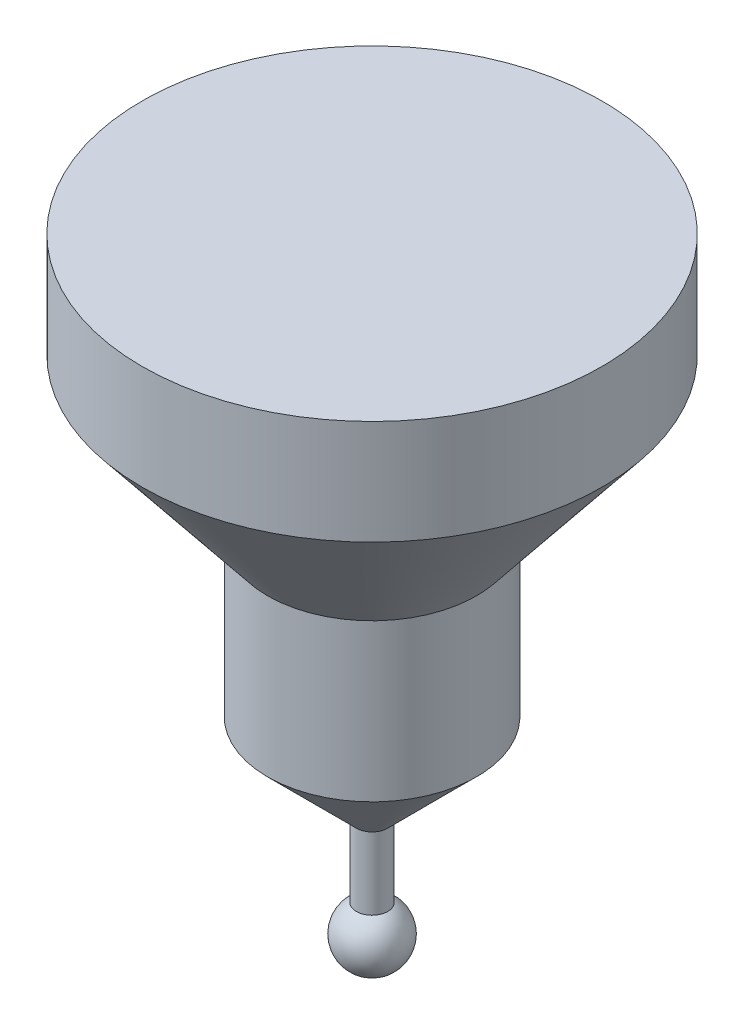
ISO-10303-21;
HEADER;
FILE_DESCRIPTION(('STEP AP214'),'2;1');
FILE_NAME('part.step','',(''),(''),'','','');
FILE_SCHEMA(('AUTOMOTIVE_DESIGN { 1 0 10303 214 1 1 1 1 }'));
ENDSEC;
DATA;
#1=APPLICATION_CONTEXT('core data for automotive mechanical design processes');
#2=APPLICATION_PROTOCOL_DEFINITION('international standard','automotive_design',2000,#1);
#3=PRODUCT_CONTEXT('',#1,'mechanical');
#4=PRODUCT('Part','Part','',(#3));
#5=PRODUCT_RELATED_PRODUCT_CATEGORY('part','',(#4));
#6=PRODUCT_DEFINITION_FORMATION('','',#4);
#7=PRODUCT_DEFINITION_CONTEXT('part definition',#1,'design');
#8=PRODUCT_DEFINITION('design','',#6,#7);
#9=PRODUCT_DEFINITION_SHAPE('','',#8);
#10=(LENGTH_UNIT() NAMED_UNIT(*) SI_UNIT(.MILLI.,.METRE.));
#11=(NAMED_UNIT(*) PLANE_ANGLE_UNIT() SI_UNIT($,.RADIAN.));
#12=(NAMED_UNIT(*) SI_UNIT($,.STERADIAN.) SOLID_ANGLE_UNIT());
#13=UNCERTAINTY_MEASURE_WITH_UNIT(LENGTH_MEASURE(1.E-05),#10,'distance_accuracy_value','');
#14=(GEOMETRIC_REPRESENTATION_CONTEXT(3) GLOBAL_UNCERTAINTY_ASSIGNED_CONTEXT((#13)) GLOBAL_UNIT_ASSIGNED_CONTEXT((#10,
#11,#12)) REPRESENTATION_CONTEXT('',''));
#15=CARTESIAN_POINT('',(0.,0.,0.));
#16=DIRECTION('',(0.,0.,1.));
#17=DIRECTION('',(1.,0.,0.));
#18=AXIS2_PLACEMENT_3D('',#15,#16,#17);
#19=CARTESIAN_POINT('',(0.,0.,0.));
#20=DIRECTION('',(0.,1.,0.));
#21=DIRECTION('',(-1.,0.,0.));
#22=AXIS2_PLACEMENT_3D('',#19,#20,#21);
#23=SPHERICAL_SURFACE('',#22,3.);
#24=CARTESIAN_POINT('',(0.,2.59807621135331,0.));
#25=DIRECTION('',(0.,1.,0.));
#26=DIRECTION('',(0.,0.,1.));
#27=AXIS2_PLACEMENT_3D('',#24,#25,#26);
#28=CIRCLE('',#27,1.50000000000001);
#29=CARTESIAN_POINT('',(0.,2.59807621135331,1.50000000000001));
#30=VERTEX_POINT('',#29);
#31=EDGE_CURVE('E10',#30,#30,#28,.T.);
#32=ORIENTED_EDGE('',*,*,#31,.F.);
#33=EDGE_LOOP('',(#32));
#34=FACE_BOUND('',#33,.T.);
#35=ADVANCED_FACE('F30',(#34),#23,.T.);
#36=CARTESIAN_POINT('',(0.,67.2438317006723,0.));
#37=DIRECTION('',(0.,1.,0.));
#38=DIRECTION('',(0.,0.,1.));
#39=AXIS2_PLACEMENT_3D('',#36,#37,#38);
#40=CYLINDRICAL_SURFACE('',#39,1.50000000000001);
#41=CARTESIAN_POINT('',(0.,9.4999999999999,0.));
#42=DIRECTION('',(0.,1.,0.));
#43=DIRECTION('',(0.,0.,1.));
#44=AXIS2_PLACEMENT_3D('',#41,#42,#43);
#45=CIRCLE('',#44,1.50000000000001);
#46=CARTESIAN_POINT('',(0.,9.4999999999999,1.50000000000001));
#47=VERTEX_POINT('',#46);
#48=EDGE_CURVE('E36',#47,#47,#45,.T.);
#49=ORIENTED_EDGE('',*,*,#48,.F.);
#50=EDGE_LOOP('',(#49));
#51=FACE_BOUND('',#50,.T.);
#52=ORIENTED_EDGE('',*,*,#31,.T.);
#53=EDGE_LOOP('',(#52));
#54=FACE_BOUND('',#53,.T.);
#55=ADVANCED_FACE('F78',(#51,#54),#40,.T.);
#56=CARTESIAN_POINT('',(0.,9.4999999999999,0.));
#57=DIRECTION('',(0.,1.,0.));
#58=DIRECTION('',(0.,0.,1.));
#59=AXIS2_PLACEMENT_3D('',#56,#57,#58);
#60=CONICAL_SURFACE('',#59,1.50000000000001,0.785398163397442);
#61=CARTESIAN_POINT('',(0.,18.,0.));
#62=DIRECTION('',(0.,1.,0.));
#63=DIRECTION('',(0.,0.,1.));
#64=AXIS2_PLACEMENT_3D('',#61,#62,#63);
#65=CIRCLE('',#64,10.);
#66=CARTESIAN_POINT('',(0.,18.,10.));
#67=VERTEX_POINT('',#66);
#68=EDGE_CURVE('E40',#67,#67,#65,.T.);
#69=CARTESIAN_POINT('',(0.,18.,10.));
#70=CARTESIAN_POINT('',(0.,17.9114583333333,9.91145833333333));
#71=CARTESIAN_POINT('',(0.,17.8229166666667,9.82291666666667));
#72=CARTESIAN_POINT('',(0.,17.6458333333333,9.64583333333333));
#73=CARTESIAN_POINT('',(0.,17.5572916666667,9.55729166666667));
#74=CARTESIAN_POINT('',(0.,17.3802083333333,9.38020833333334));
#75=CARTESIAN_POINT('',(0.,17.2916666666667,9.29166666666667));
#76=CARTESIAN_POINT('',(0.,17.1145833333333,9.11458333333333));
#77=CARTESIAN_POINT('',(0.,17.0260416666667,9.02604166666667));
#78=CARTESIAN_POINT('',(0.,16.8489583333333,8.84895833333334));
#79=CARTESIAN_POINT('',(0.,16.7604166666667,8.76041666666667));
#80=CARTESIAN_POINT('',(0.,16.5833333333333,8.58333333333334));
#81=CARTESIAN_POINT('',(0.,16.4947916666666,8.49479166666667));
#82=CARTESIAN_POINT('',(0.,16.3177083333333,8.31770833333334));
#83=CARTESIAN_POINT('',(0.,16.2291666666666,8.22916666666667));
#84=CARTESIAN_POINT('',(0.,16.0520833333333,8.05208333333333));
#85=CARTESIAN_POINT('',(0.,15.9635416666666,7.96354166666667));
#86=CARTESIAN_POINT('',(0.,15.7864583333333,7.78645833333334));
#87=CARTESIAN_POINT('',(0.,15.6979166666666,7.69791666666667));
#88=CARTESIAN_POINT('',(0.,15.5208333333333,7.52083333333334));
#89=CARTESIAN_POINT('',(0.,15.4322916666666,7.43229166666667));
#90=CARTESIAN_POINT('',(0.,15.2552083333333,7.25520833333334));
#91=CARTESIAN_POINT('',(0.,15.1666666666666,7.16666666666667));
#92=CARTESIAN_POINT('',(0.,14.9895833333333,6.98958333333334));
#93=CARTESIAN_POINT('',(0.,14.9010416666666,6.90104166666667));
#94=CARTESIAN_POINT('',(0.,14.7239583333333,6.72395833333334));
#95=CARTESIAN_POINT('',(0.,14.6354166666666,6.63541666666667));
#96=CARTESIAN_POINT('',(0.,14.4583333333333,6.45833333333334));
#97=CARTESIAN_POINT('',(0.,14.3697916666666,6.36979166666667));
#98=CARTESIAN_POINT('',(0.,14.1927083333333,6.19270833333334));
#99=CARTESIAN_POINT('',(0.,14.1041666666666,6.10416666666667));
#100=CARTESIAN_POINT('',(0.,13.9270833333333,5.92708333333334));
#101=CARTESIAN_POINT('',(0.,13.8385416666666,5.83854166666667));
#102=CARTESIAN_POINT('',(0.,13.6614583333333,5.66145833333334));
#103=CARTESIAN_POINT('',(0.,13.5729166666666,5.57291666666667));
#104=CARTESIAN_POINT('',(0.,13.3958333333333,5.39583333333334));
#105=CARTESIAN_POINT('',(0.,13.3072916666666,5.30729166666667));
#106=CARTESIAN_POINT('',(0.,13.1302083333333,5.13020833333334));
#107=CARTESIAN_POINT('',(0.,13.0416666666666,5.04166666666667));
#108=CARTESIAN_POINT('',(0.,12.8645833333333,4.86458333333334));
#109=CARTESIAN_POINT('',(0.,12.7760416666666,4.77604166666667));
#110=CARTESIAN_POINT('',(0.,12.5989583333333,4.59895833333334));
#111=CARTESIAN_POINT('',(0.,12.5104166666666,4.51041666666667));
#112=CARTESIAN_POINT('',(0.,12.3333333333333,4.33333333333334));
#113=CARTESIAN_POINT('',(0.,12.2447916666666,4.24479166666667));
#114=CARTESIAN_POINT('',(0.,12.0677083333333,4.06770833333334));
#115=CARTESIAN_POINT('',(0.,11.9791666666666,3.97916666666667));
#116=CARTESIAN_POINT('',(0.,11.8020833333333,3.80208333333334));
#117=CARTESIAN_POINT('',(0.,11.7135416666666,3.71354166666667));
#118=CARTESIAN_POINT('',(0.,11.5364583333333,3.53645833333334));
#119=CARTESIAN_POINT('',(0.,11.4479166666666,3.44791666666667));
#120=CARTESIAN_POINT('',(0.,11.2708333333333,3.27083333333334));
#121=CARTESIAN_POINT('',(0.,11.1822916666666,3.18229166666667));
#122=CARTESIAN_POINT('',(0.,11.0052083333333,3.00520833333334));
#123=CARTESIAN_POINT('',(0.,10.9166666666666,2.91666666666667));
#124=CARTESIAN_POINT('',(0.,10.7395833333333,2.73958333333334));
#125=CARTESIAN_POINT('',(0.,10.6510416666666,2.65104166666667));
#126=CARTESIAN_POINT('',(0.,10.4739583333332,2.47395833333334));
#127=CARTESIAN_POINT('',(0.,10.3854166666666,2.38541666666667));
#128=CARTESIAN_POINT('',(0.,10.2083333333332,2.20833333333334));
#129=CARTESIAN_POINT('',(0.,10.1197916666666,2.11979166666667));
#130=CARTESIAN_POINT('',(0.,9.94270833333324,1.94270833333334));
#131=CARTESIAN_POINT('',(0.,9.85416666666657,1.85416666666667));
#132=CARTESIAN_POINT('',(0.,9.67708333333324,1.67708333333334));
#133=CARTESIAN_POINT('',(0.,9.58854166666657,1.58854166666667));
#134=CARTESIAN_POINT('',(0.,9.4999999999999,1.50000000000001));
#135=B_SPLINE_CURVE_WITH_KNOTS('',3,(#69,#70,#71,#72,#73,#74,#75,#76,#77,#78,#79,#80,#81,#82,
#83,#84,#85,#86,#87,#88,#89,#90,#91,#92,#93,#94,#95,#96,#97,#98,#99,#100,#101,#102,#103,#104,
#105,#106,#107,#108,#109,#110,#111,#112,#113,#114,#115,#116,#117,#118,#119,#120,#121,#122,#123,
#124,#125,#126,#127,#128,#129,#130,#131,#132,#133,#134),.UNSPECIFIED.,.F.,.F.,(4,2,2,2,2,2,2,2,
2,2,2,2,2,2,2,2,2,2,2,2,2,2,2,2,2,2,2,2,2,2,2,2,4),(0.,0.375650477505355,0.751300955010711,
1.12695143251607,1.50260191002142,1.87825238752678,2.25390286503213,2.62955334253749,
3.00520382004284,3.3808542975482,3.75650477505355,4.13215525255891,4.50780573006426,
4.88345620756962,5.25910668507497,5.63475716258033,6.01040764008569,6.38605811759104,
6.7617085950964,7.13735907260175,7.51300955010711,7.88866002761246,8.26431050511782,
8.63996098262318,9.01561146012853,9.39126193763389,9.76691241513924,10.1425628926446,
10.51821337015,10.8938638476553,11.2695143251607,11.645164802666,12.0208152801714),.UNSPECIFIED.);
#136=EDGE_CURVE('BSEAM73',#67,#47,#135,.T.);
#137=ORIENTED_EDGE('',*,*,#68,.F.);
#138=ORIENTED_EDGE('',*,*,#48,.T.);
#139=ORIENTED_EDGE('',*,*,#136,.T.);
#140=ORIENTED_EDGE('',*,*,#136,.F.);
#141=EDGE_LOOP('',(#137,#139,#138,#140));
#142=FACE_BOUND('',#141,.T.);
#143=ADVANCED_FACE('F73',(#142),#60,.T.);
#144=CARTESIAN_POINT('',(0.,67.2438317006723,0.));
#145=DIRECTION('',(0.,1.,0.));
#146=DIRECTION('',(0.,0.,1.));
#147=AXIS2_PLACEMENT_3D('',#144,#145,#146);
#148=CYLINDRICAL_SURFACE('',#147,10.);
#149=CARTESIAN_POINT('',(0.,33.,0.));
#150=DIRECTION('',(0.,1.,0.));
#151=DIRECTION('',(0.,0.,1.));
#152=AXIS2_PLACEMENT_3D('',#149,#150,#151);
#153=CIRCLE('',#152,10.);
#154=CARTESIAN_POINT('',(0.,33.,10.));
#155=VERTEX_POINT('',#154);
#156=EDGE_CURVE('E44',#155,#155,#153,.T.);
#157=ORIENTED_EDGE('',*,*,#156,.F.);
#158=EDGE_LOOP('',(#157));
#159=FACE_BOUND('',#158,.T.);
#160=ORIENTED_EDGE('',*,*,#68,.T.);
#161=EDGE_LOOP('',(#160));
#162=FACE_BOUND('',#161,.T.);
#163=ADVANCED_FACE('F67',(#159,#162),#148,.T.);
#164=CARTESIAN_POINT('',(0.,33.,0.));
#165=DIRECTION('',(0.,1.,0.));
#166=DIRECTION('',(0.,0.,1.));
#167=AXIS2_PLACEMENT_3D('',#164,#165,#166);
#168=CONICAL_SURFACE('',#167,10.,0.674740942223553);
#169=CARTESIAN_POINT('',(0.,48.,0.));
#170=DIRECTION('',(0.,1.,0.));
#171=DIRECTION('',(0.,0.,1.));
#172=AXIS2_PLACEMENT_3D('',#169,#170,#171);
#173=CIRCLE('',#172,22.);
#174=CARTESIAN_POINT('',(0.,48.,22.));
#175=VERTEX_POINT('',#174);
#176=EDGE_CURVE('E49',#175,#175,#173,.T.);
#177=ORIENTED_EDGE('',*,*,#176,.F.);
#178=EDGE_LOOP('',(#177));
#179=FACE_BOUND('',#178,.T.);
#180=ORIENTED_EDGE('',*,*,#156,.T.);
#181=EDGE_LOOP('',(#180));
#182=FACE_BOUND('',#181,.T.);
#183=ADVANCED_FACE('F61',(#179,#182),#168,.T.);
#184=CARTESIAN_POINT('',(0.,67.2438317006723,0.));
#185=DIRECTION('',(0.,1.,0.));
#186=DIRECTION('',(0.,0.,1.));
#187=AXIS2_PLACEMENT_3D('',#184,#185,#186);
#188=CYLINDRICAL_SURFACE('',#187,22.);
#189=CARTESIAN_POINT('',(0.,58.,0.));
#190=DIRECTION('',(0.,1.,0.));
#191=DIRECTION('',(0.,0.,1.));
#192=AXIS2_PLACEMENT_3D('',#189,#190,#191);
#193=CIRCLE('',#192,22.);
#194=CARTESIAN_POINT('',(0.,58.,22.));
#195=VERTEX_POINT('',#194);
#196=EDGE_CURVE('E52',#195,#195,#193,.T.);
#197=ORIENTED_EDGE('',*,*,#196,.F.);
#198=EDGE_LOOP('',(#197));
#199=FACE_BOUND('',#198,.T.);
#200=ORIENTED_EDGE('',*,*,#176,.T.);
#201=EDGE_LOOP('',(#200));
#202=FACE_BOUND('',#201,.T.);
#203=ADVANCED_FACE('F58',(#199,#202),#188,.T.);
#204=CARTESIAN_POINT('',(0.,58.,0.));
#205=DIRECTION('',(0.,-1.,0.));
#206=DIRECTION('',(0.,0.,-1.));
#207=AXIS2_PLACEMENT_3D('',#204,#205,#206);
#208=PLANE('',#207);
#209=ORIENTED_EDGE('',*,*,#196,.T.);
#210=EDGE_LOOP('',(#209));
#211=FACE_BOUND('',#210,.T.);
#212=ADVANCED_FACE('F56',(#211),#208,.F.);
#213=CLOSED_SHELL('',(#35,#55,#143,#163,#183,#203,#212));
#214=MANIFOLD_SOLID_BREP('B2',#213);
#215=ADVANCED_BREP_SHAPE_REPRESENTATION('',(#18,#214),#14);
#216=SHAPE_DEFINITION_REPRESENTATION(#9,#215);
ENDSEC;
END-ISO-10303-21;
